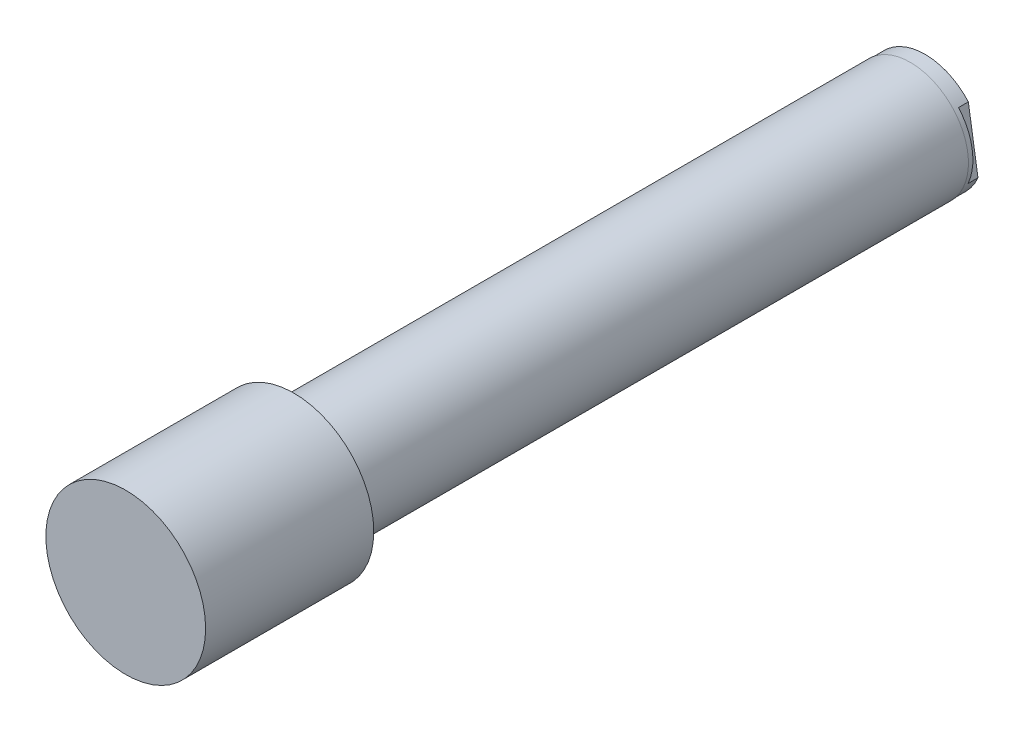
ISO-10303-21;
HEADER;
FILE_DESCRIPTION(('STEP AP214'),'2;1');
FILE_NAME('part.step','',(''),(''),'','','');
FILE_SCHEMA(('AUTOMOTIVE_DESIGN { 1 0 10303 214 1 1 1 1 }'));
ENDSEC;
DATA;
#1=APPLICATION_CONTEXT('core data for automotive mechanical design processes');
#2=APPLICATION_PROTOCOL_DEFINITION('international standard','automotive_design',2000,#1);
#3=PRODUCT_CONTEXT('',#1,'mechanical');
#4=PRODUCT('Part','Part','',(#3));
#5=PRODUCT_RELATED_PRODUCT_CATEGORY('part','',(#4));
#6=PRODUCT_DEFINITION_FORMATION('','',#4);
#7=PRODUCT_DEFINITION_CONTEXT('part definition',#1,'design');
#8=PRODUCT_DEFINITION('design','',#6,#7);
#9=PRODUCT_DEFINITION_SHAPE('','',#8);
#10=(LENGTH_UNIT() NAMED_UNIT(*) SI_UNIT(.MILLI.,.METRE.));
#11=(NAMED_UNIT(*) PLANE_ANGLE_UNIT() SI_UNIT($,.RADIAN.));
#12=(NAMED_UNIT(*) SI_UNIT($,.STERADIAN.) SOLID_ANGLE_UNIT());
#13=UNCERTAINTY_MEASURE_WITH_UNIT(LENGTH_MEASURE(1.E-05),#10,'distance_accuracy_value','');
#14=(GEOMETRIC_REPRESENTATION_CONTEXT(3) GLOBAL_UNCERTAINTY_ASSIGNED_CONTEXT((#13)) GLOBAL_UNIT_ASSIGNED_CONTEXT((#10,
#11,#12)) REPRESENTATION_CONTEXT('',''));
#15=CARTESIAN_POINT('',(0.,0.,0.));
#16=DIRECTION('',(0.,0.,1.));
#17=DIRECTION('',(1.,0.,0.));
#18=AXIS2_PLACEMENT_3D('',#15,#16,#17);
#19=CARTESIAN_POINT('',(0.,0.,33.7312));
#20=DIRECTION('',(0.,0.,-1.));
#21=DIRECTION('',(-1.,0.,0.));
#22=AXIS2_PLACEMENT_3D('',#19,#20,#21);
#23=CYLINDRICAL_SURFACE('',#22,4.96062);
#24=CARTESIAN_POINT('',(0.,0.,29.21));
#25=DIRECTION('',(0.,0.,-1.));
#26=DIRECTION('',(0.,1.,0.));
#27=AXIS2_PLACEMENT_3D('',#24,#25,#26);
#28=CIRCLE('',#27,4.96062);
#29=CARTESIAN_POINT('',(0.,4.96062,29.21));
#30=VERTEX_POINT('',#29);
#31=EDGE_CURVE('E25',#30,#30,#28,.T.);
#32=ORIENTED_EDGE('',*,*,#31,.F.);
#33=EDGE_LOOP('',(#32));
#34=FACE_BOUND('',#33,.T.);
#35=CARTESIAN_POINT('',(0.,0.,0.));
#36=DIRECTION('',(0.,0.,-1.));
#37=DIRECTION('',(0.156434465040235,-0.987688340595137,0.));
#38=AXIS2_PLACEMENT_3D('',#35,#36,#37);
#39=CIRCLE('',#38,4.96062);
#40=CARTESIAN_POINT('',(0.776011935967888,-4.89954653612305,0.));
#41=VERTEX_POINT('',#40);
#42=EDGE_CURVE('E76',#41,#41,#39,.T.);
#43=ORIENTED_EDGE('',*,*,#42,.T.);
#44=EDGE_LOOP('',(#43));
#45=FACE_BOUND('',#44,.T.);
#46=ADVANCED_FACE('F16',(#34,#45),#23,.F.);
#47=CARTESIAN_POINT('',(0.,0.,206.502));
#48=DIRECTION('',(0.,0.,1.));
#49=DIRECTION('',(1.,0.,0.));
#50=AXIS2_PLACEMENT_3D('',#47,#48,#49);
#51=PLANE('',#50);
#52=CARTESIAN_POINT('',(0.,0.,206.502));
#53=DIRECTION('',(0.,0.,1.));
#54=DIRECTION('',(1.,0.,0.));
#55=AXIS2_PLACEMENT_3D('',#52,#53,#54);
#56=CIRCLE('',#55,20.6375);
#57=CARTESIAN_POINT('',(20.6375,0.,206.502));
#58=VERTEX_POINT('',#57);
#59=EDGE_CURVE('E107',#58,#58,#56,.T.);
#60=ORIENTED_EDGE('',*,*,#59,.T.);
#61=EDGE_LOOP('',(#60));
#62=FACE_BOUND('',#61,.T.);
#63=ADVANCED_FACE('F132',(#62),#51,.T.);
#64=CARTESIAN_POINT('',(0.,0.,206.502));
#65=DIRECTION('',(0.,0.,-1.));
#66=DIRECTION('',(-1.,0.,0.));
#67=AXIS2_PLACEMENT_3D('',#64,#65,#66);
#68=CYLINDRICAL_SURFACE('',#67,20.6375);
#69=ORIENTED_EDGE('',*,*,#59,.F.);
#70=EDGE_LOOP('',(#69));
#71=FACE_BOUND('',#70,.T.);
#72=CARTESIAN_POINT('',(0.,0.,163.068));
#73=DIRECTION('',(0.,0.,1.));
#74=DIRECTION('',(1.,0.,0.));
#75=AXIS2_PLACEMENT_3D('',#72,#73,#74);
#76=CIRCLE('',#75,20.6375);
#77=CARTESIAN_POINT('',(20.6375,0.,163.068));
#78=VERTEX_POINT('',#77);
#79=EDGE_CURVE('E105',#78,#78,#76,.T.);
#80=ORIENTED_EDGE('',*,*,#79,.T.);
#81=EDGE_LOOP('',(#80));
#82=FACE_BOUND('',#81,.T.);
#83=ADVANCED_FACE('F121',(#71,#82),#68,.T.);
#84=CARTESIAN_POINT('',(0.,0.,163.068));
#85=DIRECTION('',(0.,0.,1.));
#86=DIRECTION('',(1.,0.,0.));
#87=AXIS2_PLACEMENT_3D('',#84,#85,#86);
#88=PLANE('',#87);
#89=CARTESIAN_POINT('',(0.,0.,163.068));
#90=DIRECTION('',(0.,0.,1.));
#91=DIRECTION('',(1.,0.,0.));
#92=AXIS2_PLACEMENT_3D('',#89,#90,#91);
#93=CIRCLE('',#92,14.9987);
#94=CARTESIAN_POINT('',(14.9987,0.,163.068));
#95=VERTEX_POINT('',#94);
#96=EDGE_CURVE('E72',#95,#95,#93,.F.);
#97=ORIENTED_EDGE('',*,*,#96,.F.);
#98=EDGE_LOOP('',(#97));
#99=FACE_BOUND('',#98,.T.);
#100=ORIENTED_EDGE('',*,*,#79,.F.);
#101=EDGE_LOOP('',(#100));
#102=FACE_BOUND('',#101,.T.);
#103=ADVANCED_FACE('F118',(#99,#102),#88,.F.);
#104=CARTESIAN_POINT('',(0.,0.,163.068));
#105=DIRECTION('',(0.,0.,-1.));
#106=DIRECTION('',(-1.,0.,0.));
#107=AXIS2_PLACEMENT_3D('',#104,#105,#106);
#108=CYLINDRICAL_SURFACE('',#107,14.9987);
#109=CARTESIAN_POINT('',(0.,0.,3.81));
#110=DIRECTION('',(0.,0.,-1.));
#111=DIRECTION('',(-1.,0.,0.));
#112=AXIS2_PLACEMENT_3D('',#109,#110,#111);
#113=CIRCLE('',#112,14.9987);
#114=CARTESIAN_POINT('',(-14.9987,0.,3.81));
#115=VERTEX_POINT('',#114);
#116=EDGE_CURVE('E69',#115,#115,#113,.T.);
#117=ORIENTED_EDGE('',*,*,#116,.F.);
#118=EDGE_LOOP('',(#117));
#119=FACE_BOUND('',#118,.T.);
#120=ORIENTED_EDGE('',*,*,#96,.T.);
#121=EDGE_LOOP('',(#120));
#122=FACE_BOUND('',#121,.T.);
#123=ADVANCED_FACE('F116',(#119,#122),#108,.T.);
#124=CARTESIAN_POINT('',(0.,0.,3.81));
#125=DIRECTION('',(0.,0.,-1.));
#126=DIRECTION('',(-1.,0.,0.));
#127=AXIS2_PLACEMENT_3D('',#124,#125,#126);
#128=PLANE('',#127);
#129=CARTESIAN_POINT('',(0.,0.,3.81));
#130=DIRECTION('',(0.,0.,-1.));
#131=DIRECTION('',(0.,1.,0.));
#132=AXIS2_PLACEMENT_3D('',#129,#130,#131);
#133=CIRCLE('',#132,14.8844);
#134=CARTESIAN_POINT('',(0.,14.8844,3.81));
#135=VERTEX_POINT('',#134);
#136=EDGE_CURVE('E10',#135,#135,#133,.T.);
#137=ORIENTED_EDGE('',*,*,#136,.F.);
#138=EDGE_LOOP('',(#137));
#139=FACE_BOUND('',#138,.T.);
#140=ORIENTED_EDGE('',*,*,#116,.T.);
#141=EDGE_LOOP('',(#140));
#142=FACE_BOUND('',#141,.T.);
#143=ADVANCED_FACE('F129',(#139,#142),#128,.T.);
#144=CARTESIAN_POINT('',(0.,0.,2.54));
#145=DIRECTION('',(0.,0.,-1.));
#146=DIRECTION('',(0.156434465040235,-0.987688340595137,0.));
#147=AXIS2_PLACEMENT_3D('',#144,#145,#146);
#148=PLANE('',#147);
#149=DIRECTION('',(0.156434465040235,-0.987688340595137,0.));
#150=VECTOR('',#149,1.);
#151=CARTESIAN_POINT('',(11.1719712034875,9.83526424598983,2.54));
#152=LINE('',#151,#150);
#153=CARTESIAN_POINT('',(11.1719712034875,9.83526424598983,2.54));
#154=VERTEX_POINT('',#153);
#155=CARTESIAN_POINT('',(13.6644398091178,-5.90156318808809,2.54));
#156=VERTEX_POINT('',#155);
#157=EDGE_CURVE('E80',#154,#156,#152,.T.);
#158=ORIENTED_EDGE('',*,*,#157,.F.);
#159=CARTESIAN_POINT('',(0.,0.,2.54));
#160=DIRECTION('',(0.,0.,-1.));
#161=DIRECTION('',(0.156434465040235,-0.987688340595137,0.));
#162=AXIS2_PLACEMENT_3D('',#159,#160,#161);
#163=CIRCLE('',#162,14.8844);
#164=EDGE_CURVE('E20',#156,#154,#163,.F.);
#165=ORIENTED_EDGE('',*,*,#164,.F.);
#166=EDGE_LOOP('',(#158,#165));
#167=FACE_BOUND('',#166,.T.);
#168=ADVANCED_FACE('F139',(#167),#148,.T.);
#169=CARTESIAN_POINT('',(11.1719712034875,9.83526424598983,2.54));
#170=DIRECTION('',(0.987688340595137,0.156434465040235,0.));
#171=DIRECTION('',(0.,0.,1.));
#172=AXIS2_PLACEMENT_3D('',#169,#170,#171);
#173=PLANE('',#172);
#174=DIRECTION('',(0.156434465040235,-0.987688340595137,0.));
#175=VECTOR('',#174,1.);
#176=CARTESIAN_POINT('',(11.1719712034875,9.83526424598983,0.));
#177=LINE('',#176,#175);
#178=CARTESIAN_POINT('',(11.1719712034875,9.83526424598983,0.));
#179=VERTEX_POINT('',#178);
#180=CARTESIAN_POINT('',(13.6644398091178,-5.90156318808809,0.));
#181=VERTEX_POINT('',#180);
#182=EDGE_CURVE('E79',#179,#181,#177,.T.);
#183=ORIENTED_EDGE('',*,*,#182,.F.);
#184=DIRECTION('',(0.,0.,-1.));
#185=VECTOR('',#184,1.);
#186=CARTESIAN_POINT('',(11.1719712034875,9.83526424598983,2.54));
#187=LINE('',#186,#185);
#188=EDGE_CURVE('E85',#154,#179,#187,.T.);
#189=ORIENTED_EDGE('',*,*,#188,.F.);
#190=ORIENTED_EDGE('',*,*,#157,.T.);
#191=DIRECTION('',(0.,0.,-1.));
#192=VECTOR('',#191,1.);
#193=CARTESIAN_POINT('',(13.6644398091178,-5.90156318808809,2.54));
#194=LINE('',#193,#192);
#195=EDGE_CURVE('E33',#156,#181,#194,.T.);
#196=ORIENTED_EDGE('',*,*,#195,.T.);
#197=EDGE_LOOP('',(#183,#189,#190,#196));
#198=FACE_BOUND('',#197,.T.);
#199=ADVANCED_FACE('F147',(#198),#173,.T.);
#200=DIRECTION('',(-0.156434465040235,0.987688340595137,0.));
#201=VECTOR('',#200,1.);
#202=CARTESIAN_POINT('',(-13.6644398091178,5.90156318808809,2.54));
#203=LINE('',#202,#201);
#204=CARTESIAN_POINT('',(-11.1719712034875,-9.83526424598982,2.54));
#205=VERTEX_POINT('',#204);
#206=CARTESIAN_POINT('',(-13.6644398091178,5.90156318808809,2.54));
#207=VERTEX_POINT('',#206);
#208=EDGE_CURVE('E82',#205,#207,#203,.T.);
#209=ORIENTED_EDGE('',*,*,#208,.F.);
#210=EDGE_CURVE('E100',#207,#205,#163,.F.);
#211=ORIENTED_EDGE('',*,*,#210,.F.);
#212=EDGE_LOOP('',(#209,#211));
#213=FACE_BOUND('',#212,.T.);
#214=ADVANCED_FACE('F146',(#213),#148,.T.);
#215=CARTESIAN_POINT('',(-13.6644398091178,5.90156318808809,2.54));
#216=DIRECTION('',(-0.987688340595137,-0.156434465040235,0.));
#217=DIRECTION('',(0.,0.,-1.));
#218=AXIS2_PLACEMENT_3D('',#215,#216,#217);
#219=PLANE('',#218);
#220=DIRECTION('',(-0.156434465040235,0.987688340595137,0.));
#221=VECTOR('',#220,1.);
#222=CARTESIAN_POINT('',(-13.6644398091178,5.90156318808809,0.));
#223=LINE('',#222,#221);
#224=CARTESIAN_POINT('',(-11.1719712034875,-9.83526424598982,0.));
#225=VERTEX_POINT('',#224);
#226=CARTESIAN_POINT('',(-13.6644398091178,5.90156318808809,0.));
#227=VERTEX_POINT('',#226);
#228=EDGE_CURVE('E83',#225,#227,#223,.T.);
#229=ORIENTED_EDGE('',*,*,#228,.F.);
#230=DIRECTION('',(0.,0.,-1.));
#231=VECTOR('',#230,1.);
#232=CARTESIAN_POINT('',(-11.1719712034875,-9.83526424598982,2.54));
#233=LINE('',#232,#231);
#234=EDGE_CURVE('E90',#205,#225,#233,.T.);
#235=ORIENTED_EDGE('',*,*,#234,.F.);
#236=ORIENTED_EDGE('',*,*,#208,.T.);
#237=DIRECTION('',(0.,0.,-1.));
#238=VECTOR('',#237,1.);
#239=CARTESIAN_POINT('',(-13.6644398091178,5.90156318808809,2.54));
#240=LINE('',#239,#238);
#241=EDGE_CURVE('E41',#207,#227,#240,.T.);
#242=ORIENTED_EDGE('',*,*,#241,.T.);
#243=EDGE_LOOP('',(#229,#235,#236,#242));
#244=FACE_BOUND('',#243,.T.);
#245=ADVANCED_FACE('F142',(#244),#219,.T.);
#246=CARTESIAN_POINT('',(0.,0.,0.));
#247=DIRECTION('',(0.,0.,-1.));
#248=DIRECTION('',(0.156434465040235,-0.987688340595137,0.));
#249=AXIS2_PLACEMENT_3D('',#246,#247,#248);
#250=PLANE('',#249);
#251=ORIENTED_EDGE('',*,*,#42,.F.);
#252=EDGE_LOOP('',(#251));
#253=FACE_BOUND('',#252,.T.);
#254=CARTESIAN_POINT('',(0.,0.,0.));
#255=DIRECTION('',(0.,0.,-1.));
#256=DIRECTION('',(0.156434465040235,-0.987688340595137,0.));
#257=AXIS2_PLACEMENT_3D('',#254,#255,#256);
#258=CIRCLE('',#257,14.8844);
#259=EDGE_CURVE('E89',#181,#225,#258,.T.);
#260=ORIENTED_EDGE('',*,*,#259,.T.);
#261=ORIENTED_EDGE('',*,*,#228,.T.);
#262=EDGE_CURVE('E96',#227,#179,#258,.T.);
#263=ORIENTED_EDGE('',*,*,#262,.T.);
#264=ORIENTED_EDGE('',*,*,#182,.T.);
#265=EDGE_LOOP('',(#260,#261,#263,#264));
#266=FACE_BOUND('',#265,.T.);
#267=ADVANCED_FACE('F145',(#253,#266),#250,.T.);
#268=CARTESIAN_POINT('',(0.,0.,2.54));
#269=DIRECTION('',(0.,0.,-1.));
#270=DIRECTION('',(0.156434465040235,-0.987688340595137,0.));
#271=AXIS2_PLACEMENT_3D('',#268,#269,#270);
#272=CYLINDRICAL_SURFACE('',#271,14.8844);
#273=ORIENTED_EDGE('',*,*,#262,.F.);
#274=ORIENTED_EDGE('',*,*,#241,.F.);
#275=ORIENTED_EDGE('',*,*,#210,.T.);
#276=ORIENTED_EDGE('',*,*,#234,.T.);
#277=ORIENTED_EDGE('',*,*,#259,.F.);
#278=ORIENTED_EDGE('',*,*,#195,.F.);
#279=ORIENTED_EDGE('',*,*,#164,.T.);
#280=ORIENTED_EDGE('',*,*,#188,.T.);
#281=EDGE_LOOP('',(#273,#274,#275,#276,#277,#278,#279,#280));
#282=FACE_BOUND('',#281,.T.);
#283=ORIENTED_EDGE('',*,*,#136,.T.);
#284=EDGE_LOOP('',(#283));
#285=FACE_BOUND('',#284,.T.);
#286=ADVANCED_FACE('F18',(#282,#285),#272,.T.);
#287=CARTESIAN_POINT('',(0.,0.,29.21));
#288=DIRECTION('',(0.,0.,-1.));
#289=DIRECTION('',(0.156434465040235,-0.987688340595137,0.));
#290=AXIS2_PLACEMENT_3D('',#287,#288,#289);
#291=CONICAL_SURFACE('',#290,4.96062,1.02974425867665);
#292=CARTESIAN_POINT('',(0.,0.,32.1906412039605));
#293=VERTEX_POINT('',#292);
#294=VERTEX_LOOP('',#293);
#295=FACE_BOUND('',#294,.T.);
#296=ORIENTED_EDGE('',*,*,#31,.T.);
#297=EDGE_LOOP('',(#296));
#298=FACE_BOUND('',#297,.T.);
#299=ADVANCED_FACE('F62',(#295,#298),#291,.F.);
#300=CLOSED_SHELL('',(#46,#63,#83,#103,#123,#143,#168,#199,#214,#245,#267,#286,#299));
#301=MANIFOLD_SOLID_BREP('B1',#300);
#302=ADVANCED_BREP_SHAPE_REPRESENTATION('',(#18,#301),#14);
#303=SHAPE_DEFINITION_REPRESENTATION(#9,#302);
ENDSEC;
END-ISO-10303-21;
